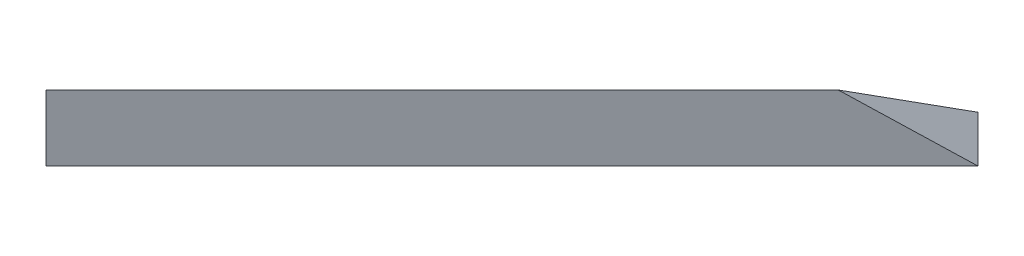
ISO-10303-21;
HEADER;
FILE_DESCRIPTION(('STEP AP214'),'2;1');
FILE_NAME('part.step','',(''),(''),'','','');
FILE_SCHEMA(('AUTOMOTIVE_DESIGN { 1 0 10303 214 1 1 1 1 }'));
ENDSEC;
DATA;
#1=APPLICATION_CONTEXT('core data for automotive mechanical design processes');
#2=APPLICATION_PROTOCOL_DEFINITION('international standard','automotive_design',2000,#1);
#3=PRODUCT_CONTEXT('',#1,'mechanical');
#4=PRODUCT('Part','Part','',(#3));
#5=PRODUCT_RELATED_PRODUCT_CATEGORY('part','',(#4));
#6=PRODUCT_DEFINITION_FORMATION('','',#4);
#7=PRODUCT_DEFINITION_CONTEXT('part definition',#1,'design');
#8=PRODUCT_DEFINITION('design','',#6,#7);
#9=PRODUCT_DEFINITION_SHAPE('','',#8);
#10=(LENGTH_UNIT() NAMED_UNIT(*) SI_UNIT(.MILLI.,.METRE.));
#11=(NAMED_UNIT(*) PLANE_ANGLE_UNIT() SI_UNIT($,.RADIAN.));
#12=(NAMED_UNIT(*) SI_UNIT($,.STERADIAN.) SOLID_ANGLE_UNIT());
#13=UNCERTAINTY_MEASURE_WITH_UNIT(LENGTH_MEASURE(1.E-05),#10,'distance_accuracy_value','');
#14=(GEOMETRIC_REPRESENTATION_CONTEXT(3) GLOBAL_UNCERTAINTY_ASSIGNED_CONTEXT((#13)) GLOBAL_UNIT_ASSIGNED_CONTEXT((#10,
#11,#12)) REPRESENTATION_CONTEXT('',''));
#15=CARTESIAN_POINT('',(0.,0.,0.));
#16=DIRECTION('',(0.,0.,1.));
#17=DIRECTION('',(1.,0.,0.));
#18=AXIS2_PLACEMENT_3D('',#15,#16,#17);
#19=CARTESIAN_POINT('',(-334.960229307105,6.83625031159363,59.9691207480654));
#20=DIRECTION('',(0.,1.,0.));
#21=DIRECTION('',(-0.707106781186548,0.,0.707106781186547));
#22=AXIS2_PLACEMENT_3D('',#19,#20,#21);
#23=PLANE('',#22);
#24=DIRECTION('',(-0.707106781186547,0.,-0.707106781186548));
#25=VECTOR('',#24,1.);
#26=CARTESIAN_POINT('',(-334.960229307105,6.83625031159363,59.9691207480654));
#27=LINE('',#26,#25);
#28=CARTESIAN_POINT('',(-337.081549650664,6.83625031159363,57.8478004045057));
#29=VERTEX_POINT('',#28);
#30=CARTESIAN_POINT('',(-339.202867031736,6.83625031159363,55.7264830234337));
#31=VERTEX_POINT('',#30);
#32=EDGE_CURVE('E33',#29,#31,#27,.T.);
#33=ORIENTED_EDGE('',*,*,#32,.F.);
#34=DIRECTION('',(0.707106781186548,0.,-0.707106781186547));
#35=VECTOR('',#34,1.);
#36=CARTESIAN_POINT('',(-337.081549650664,6.83625031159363,57.8478004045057));
#37=LINE('',#36,#35);
#38=CARTESIAN_POINT('',(-358.294753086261,6.83625031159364,79.0610038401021));
#39=VERTEX_POINT('',#38);
#40=EDGE_CURVE('E65',#39,#29,#37,.T.);
#41=ORIENTED_EDGE('',*,*,#40,.F.);
#42=DIRECTION('',(0.707106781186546,0.,0.707106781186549));
#43=VECTOR('',#42,1.);
#44=CARTESIAN_POINT('',(-343.080731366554,6.83625031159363,94.2750255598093));
#45=LINE('',#44,#43);
#46=CARTESIAN_POINT('',(-360.41607342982,6.83625031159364,76.9396834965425));
#47=VERTEX_POINT('',#46);
#48=EDGE_CURVE('E58',#47,#39,#45,.T.);
#49=ORIENTED_EDGE('',*,*,#48,.F.);
#50=DIRECTION('',(0.707106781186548,0.,-0.707106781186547));
#51=VECTOR('',#50,1.);
#52=CARTESIAN_POINT('',(-374.916073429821,6.83625031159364,91.4396834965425));
#53=LINE('',#52,#51);
#54=EDGE_CURVE('E48',#47,#31,#53,.T.);
#55=ORIENTED_EDGE('',*,*,#54,.T.);
#56=EDGE_LOOP('',(#33,#41,#49,#55));
#57=FACE_BOUND('',#56,.T.);
#58=ADVANCED_FACE('F30',(#57),#23,.F.);
#59=CARTESIAN_POINT('',(-337.081549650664,6.83625031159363,57.8478004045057));
#60=DIRECTION('',(0.392232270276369,0.832050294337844,-0.392232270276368));
#61=DIRECTION('',(-0.904534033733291,0.426401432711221,0.));
#62=AXIS2_PLACEMENT_3D('',#59,#60,#61);
#63=PLANE('',#62);
#64=ORIENTED_EDGE('',*,*,#32,.T.);
#65=DIRECTION('',(0.171499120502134,-0.485071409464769,-0.857492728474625));
#66=VECTOR('',#65,1.);
#67=CARTESIAN_POINT('',(-340.263530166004,9.83625031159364,61.0297809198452));
#68=LINE('',#67,#66);
#69=CARTESIAN_POINT('',(-340.263530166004,9.83625031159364,61.0297809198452));
#70=VERTEX_POINT('',#69);
#71=EDGE_CURVE('E79',#70,#31,#68,.T.);
#72=ORIENTED_EDGE('',*,*,#71,.F.);
#73=DIRECTION('',(-0.588348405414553,0.554700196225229,0.588348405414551));
#74=VECTOR('',#73,1.);
#75=CARTESIAN_POINT('',(-358.294753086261,26.8362503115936,79.0610038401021));
#76=LINE('',#75,#74);
#77=EDGE_CURVE('E70',#29,#70,#76,.T.);
#78=ORIENTED_EDGE('',*,*,#77,.F.);
#79=EDGE_LOOP('',(#64,#72,#78));
#80=FACE_BOUND('',#79,.T.);
#81=ADVANCED_FACE('F78',(#80),#63,.T.);
#82=CARTESIAN_POINT('',(-358.294753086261,26.8362503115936,79.0610038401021));
#83=DIRECTION('',(0.707106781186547,0.,0.707106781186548));
#84=DIRECTION('',(0.707106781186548,0.,-0.707106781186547));
#85=AXIS2_PLACEMENT_3D('',#82,#83,#84);
#86=PLANE('',#85);
#87=DIRECTION('',(-0.707106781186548,0.,0.707106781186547));
#88=VECTOR('',#87,1.);
#89=CARTESIAN_POINT('',(-358.294753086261,9.83625031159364,79.0610038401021));
#90=LINE('',#89,#88);
#91=CARTESIAN_POINT('',(-358.294753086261,9.83625031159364,79.0610038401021));
#92=VERTEX_POINT('',#91);
#93=EDGE_CURVE('E39',#70,#92,#90,.T.);
#94=ORIENTED_EDGE('',*,*,#93,.T.);
#95=DIRECTION('',(0.,-1.,0.));
#96=VECTOR('',#95,1.);
#97=CARTESIAN_POINT('',(-358.294753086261,6.83625031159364,79.0610038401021));
#98=LINE('',#97,#96);
#99=EDGE_CURVE('E72',#92,#39,#98,.T.);
#100=ORIENTED_EDGE('',*,*,#99,.T.);
#101=ORIENTED_EDGE('',*,*,#40,.T.);
#102=ORIENTED_EDGE('',*,*,#77,.T.);
#103=EDGE_LOOP('',(#94,#100,#101,#102));
#104=FACE_BOUND('',#103,.T.);
#105=ADVANCED_FACE('F68',(#104),#86,.T.);
#106=CARTESIAN_POINT('',(-358.294753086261,6.83625031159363,79.0610038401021));
#107=DIRECTION('',(0.707106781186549,0.,-0.707106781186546));
#108=DIRECTION('',(-0.707106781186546,0.,-0.707106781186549));
#109=AXIS2_PLACEMENT_3D('',#106,#107,#108);
#110=PLANE('',#109);
#111=ORIENTED_EDGE('',*,*,#48,.T.);
#112=ORIENTED_EDGE('',*,*,#99,.F.);
#113=DIRECTION('',(-0.500000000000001,-0.707106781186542,-0.500000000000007));
#114=VECTOR('',#113,1.);
#115=CARTESIAN_POINT('',(-358.294753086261,9.83625031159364,79.0610038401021));
#116=LINE('',#115,#114);
#117=EDGE_CURVE('E11',#92,#47,#116,.T.);
#118=ORIENTED_EDGE('',*,*,#117,.T.);
#119=EDGE_LOOP('',(#111,#112,#118));
#120=FACE_BOUND('',#119,.T.);
#121=ADVANCED_FACE('F86',(#120),#110,.F.);
#122=CARTESIAN_POINT('',(-359.355413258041,8.33625031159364,78.0003436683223));
#123=DIRECTION('',(0.500000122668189,-0.707106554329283,0.500000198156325));
#124=DIRECTION('',(0.,-0.577350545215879,-0.81649638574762));
#125=AXIS2_PLACEMENT_3D('',#122,#123,#124);
#126=PLANE('',#125);
#127=ORIENTED_EDGE('',*,*,#54,.F.);
#128=ORIENTED_EDGE('',*,*,#117,.F.);
#129=ORIENTED_EDGE('',*,*,#93,.F.);
#130=ORIENTED_EDGE('',*,*,#71,.T.);
#131=EDGE_LOOP('',(#127,#128,#129,#130));
#132=FACE_BOUND('',#131,.T.);
#133=ADVANCED_FACE('F85',(#132),#126,.F.);
#134=CLOSED_SHELL('',(#58,#81,#105,#121,#133));
#135=MANIFOLD_SOLID_BREP('B2',#134);
#136=ADVANCED_BREP_SHAPE_REPRESENTATION('',(#18,#135),#14);
#137=SHAPE_DEFINITION_REPRESENTATION(#9,#136);
ENDSEC;
END-ISO-10303-21;
